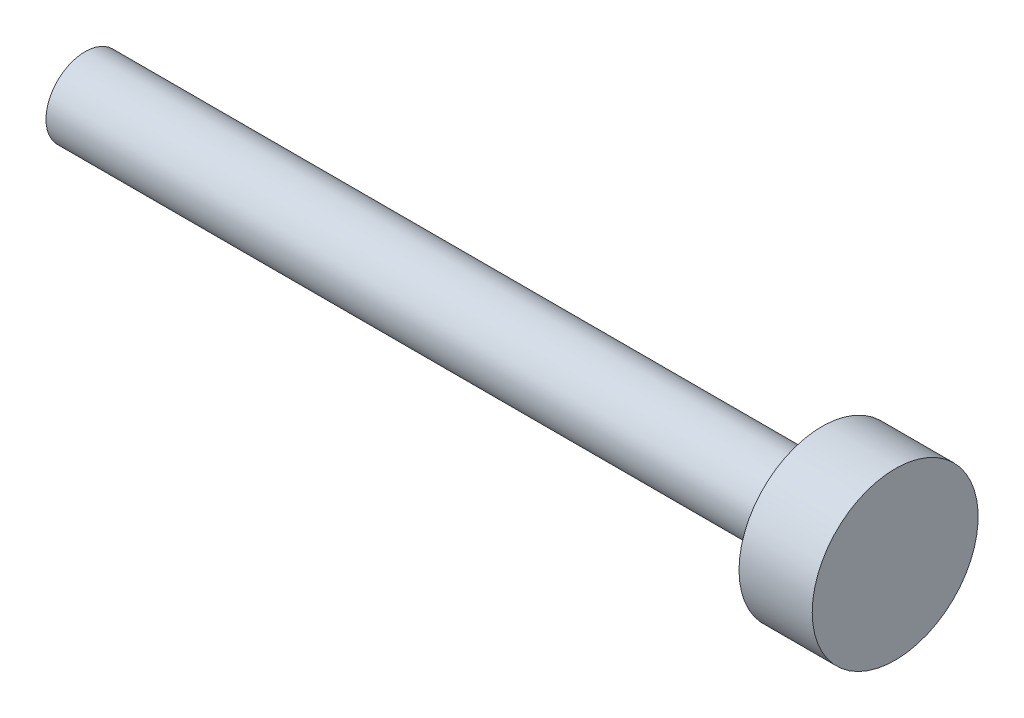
ISO-10303-21;
HEADER;
FILE_DESCRIPTION(('STEP AP214'),'2;1');
FILE_NAME('part.step','',(''),(''),'','','');
FILE_SCHEMA(('AUTOMOTIVE_DESIGN { 1 0 10303 214 1 1 1 1 }'));
ENDSEC;
DATA;
#1=APPLICATION_CONTEXT('core data for automotive mechanical design processes');
#2=APPLICATION_PROTOCOL_DEFINITION('international standard','automotive_design',2000,#1);
#3=PRODUCT_CONTEXT('',#1,'mechanical');
#4=PRODUCT('Part','Part','',(#3));
#5=PRODUCT_RELATED_PRODUCT_CATEGORY('part','',(#4));
#6=PRODUCT_DEFINITION_FORMATION('','',#4);
#7=PRODUCT_DEFINITION_CONTEXT('part definition',#1,'design');
#8=PRODUCT_DEFINITION('design','',#6,#7);
#9=PRODUCT_DEFINITION_SHAPE('','',#8);
#10=(LENGTH_UNIT() NAMED_UNIT(*) SI_UNIT(.MILLI.,.METRE.));
#11=(NAMED_UNIT(*) PLANE_ANGLE_UNIT() SI_UNIT($,.RADIAN.));
#12=(NAMED_UNIT(*) SI_UNIT($,.STERADIAN.) SOLID_ANGLE_UNIT());
#13=UNCERTAINTY_MEASURE_WITH_UNIT(LENGTH_MEASURE(1.E-05),#10,'distance_accuracy_value','');
#14=(GEOMETRIC_REPRESENTATION_CONTEXT(3) GLOBAL_UNCERTAINTY_ASSIGNED_CONTEXT((#13)) GLOBAL_UNIT_ASSIGNED_CONTEXT((#10,
#11,#12)) REPRESENTATION_CONTEXT('',''));
#15=CARTESIAN_POINT('',(0.,0.,0.));
#16=DIRECTION('',(0.,0.,1.));
#17=DIRECTION('',(1.,0.,0.));
#18=AXIS2_PLACEMENT_3D('',#15,#16,#17);
#19=CARTESIAN_POINT('',(43.,0.,0.));
#20=DIRECTION('',(1.,0.,0.));
#21=DIRECTION('',(0.,0.,-1.));
#22=AXIS2_PLACEMENT_3D('',#19,#20,#21);
#23=PLANE('',#22);
#24=CARTESIAN_POINT('',(43.,0.,0.));
#25=DIRECTION('',(-1.,0.,0.));
#26=DIRECTION('',(0.,0.,1.));
#27=AXIS2_PLACEMENT_3D('',#24,#25,#26);
#28=CIRCLE('',#27,4.25);
#29=CARTESIAN_POINT('',(43.,0.,4.25));
#30=VERTEX_POINT('',#29);
#31=EDGE_CURVE('E371',#30,#30,#28,.T.);
#32=ORIENTED_EDGE('',*,*,#31,.F.);
#33=EDGE_LOOP('',(#32));
#34=FACE_BOUND('',#33,.T.);
#35=CARTESIAN_POINT('',(43.,0.,0.));
#36=DIRECTION('',(-1.,0.,0.));
#37=DIRECTION('',(0.,0.,1.));
#38=AXIS2_PLACEMENT_3D('',#35,#36,#37);
#39=CIRCLE('',#38,8.);
#40=CARTESIAN_POINT('',(43.,0.,8.));
#41=VERTEX_POINT('',#40);
#42=EDGE_CURVE('E12',#41,#41,#39,.T.);
#43=ORIENTED_EDGE('',*,*,#42,.T.);
#44=EDGE_LOOP('',(#43));
#45=FACE_BOUND('',#44,.T.);
#46=ADVANCED_FACE('F351',(#34,#45),#23,.F.);
#47=CARTESIAN_POINT('',(0.,0.,0.));
#48=DIRECTION('',(-1.,0.,0.));
#49=DIRECTION('',(0.,0.,1.));
#50=AXIS2_PLACEMENT_3D('',#47,#48,#49);
#51=CYLINDRICAL_SURFACE('',#50,8.);
#52=ORIENTED_EDGE('',*,*,#42,.F.);
#53=EDGE_LOOP('',(#52));
#54=FACE_BOUND('',#53,.T.);
#55=CARTESIAN_POINT('',(194.,0.,0.));
#56=DIRECTION('',(-1.,0.,0.));
#57=DIRECTION('',(0.,0.,1.));
#58=AXIS2_PLACEMENT_3D('',#55,#56,#57);
#59=CIRCLE('',#58,8.);
#60=CARTESIAN_POINT('',(194.,0.,8.));
#61=VERTEX_POINT('',#60);
#62=EDGE_CURVE('E359',#61,#61,#59,.T.);
#63=ORIENTED_EDGE('',*,*,#62,.T.);
#64=EDGE_LOOP('',(#63));
#65=FACE_BOUND('',#64,.T.);
#66=ADVANCED_FACE('F385',(#54,#65),#51,.T.);
#67=CARTESIAN_POINT('',(194.,8.,0.));
#68=DIRECTION('',(1.,0.,0.));
#69=DIRECTION('',(0.,0.,-1.));
#70=AXIS2_PLACEMENT_3D('',#67,#68,#69);
#71=PLANE('',#70);
#72=ORIENTED_EDGE('',*,*,#62,.F.);
#73=EDGE_LOOP('',(#72));
#74=FACE_BOUND('',#73,.T.);
#75=CARTESIAN_POINT('',(194.,0.,0.));
#76=DIRECTION('',(-1.,0.,0.));
#77=DIRECTION('',(0.,0.,1.));
#78=AXIS2_PLACEMENT_3D('',#75,#76,#77);
#79=CIRCLE('',#78,17.);
#80=CARTESIAN_POINT('',(194.,0.,17.));
#81=VERTEX_POINT('',#80);
#82=EDGE_CURVE('E380',#81,#81,#79,.T.);
#83=ORIENTED_EDGE('',*,*,#82,.T.);
#84=EDGE_LOOP('',(#83));
#85=FACE_BOUND('',#84,.T.);
#86=ADVANCED_FACE('F387',(#74,#85),#71,.F.);
#87=CARTESIAN_POINT('',(0.,0.,0.));
#88=DIRECTION('',(-1.,0.,0.));
#89=DIRECTION('',(0.,0.,1.));
#90=AXIS2_PLACEMENT_3D('',#87,#88,#89);
#91=CYLINDRICAL_SURFACE('',#90,17.);
#92=ORIENTED_EDGE('',*,*,#82,.F.);
#93=EDGE_LOOP('',(#92));
#94=FACE_BOUND('',#93,.T.);
#95=CARTESIAN_POINT('',(209.,0.,0.));
#96=DIRECTION('',(-1.,0.,0.));
#97=DIRECTION('',(0.,0.,1.));
#98=AXIS2_PLACEMENT_3D('',#95,#96,#97);
#99=CIRCLE('',#98,17.);
#100=CARTESIAN_POINT('',(209.,0.,17.));
#101=VERTEX_POINT('',#100);
#102=EDGE_CURVE('E374',#101,#101,#99,.T.);
#103=ORIENTED_EDGE('',*,*,#102,.T.);
#104=EDGE_LOOP('',(#103));
#105=FACE_BOUND('',#104,.T.);
#106=ADVANCED_FACE('F390',(#94,#105),#91,.T.);
#107=CARTESIAN_POINT('',(209.,17.,0.));
#108=DIRECTION('',(-1.,0.,0.));
#109=DIRECTION('',(0.,0.,1.));
#110=AXIS2_PLACEMENT_3D('',#107,#108,#109);
#111=PLANE('',#110);
#112=ORIENTED_EDGE('',*,*,#102,.F.);
#113=EDGE_LOOP('',(#112));
#114=FACE_BOUND('',#113,.T.);
#115=ADVANCED_FACE('F396',(#114),#111,.F.);
#116=CARTESIAN_POINT('',(43.,0.,0.));
#117=DIRECTION('',(-1.,0.,0.));
#118=DIRECTION('',(0.,0.,1.));
#119=AXIS2_PLACEMENT_3D('',#116,#117,#118);
#120=CYLINDRICAL_SURFACE('',#119,4.24999999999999);
#121=CARTESIAN_POINT('',(65.5,0.,0.));
#122=DIRECTION('',(-1.,0.,0.));
#123=DIRECTION('',(0.,0.,1.));
#124=AXIS2_PLACEMENT_3D('',#121,#122,#123);
#125=CIRCLE('',#124,4.24999999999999);
#126=CARTESIAN_POINT('',(65.5,0.,4.24999999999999));
#127=VERTEX_POINT('',#126);
#128=EDGE_CURVE('E369',#127,#127,#125,.T.);
#129=ORIENTED_EDGE('',*,*,#128,.F.);
#130=EDGE_LOOP('',(#129));
#131=FACE_BOUND('',#130,.T.);
#132=ORIENTED_EDGE('',*,*,#31,.T.);
#133=EDGE_LOOP('',(#132));
#134=FACE_BOUND('',#133,.T.);
#135=ADVANCED_FACE('F365',(#131,#134),#120,.F.);
#136=CARTESIAN_POINT('',(65.5,0.,0.));
#137=DIRECTION('',(-1.,0.,0.));
#138=DIRECTION('',(0.,0.,1.));
#139=AXIS2_PLACEMENT_3D('',#136,#137,#138);
#140=CONICAL_SURFACE('',#139,4.24999999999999,1.02974425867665);
#141=CARTESIAN_POINT('',(68.0536576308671,0.,0.));
#142=VERTEX_POINT('',#141);
#143=VERTEX_LOOP('',#142);
#144=FACE_BOUND('',#143,.T.);
#145=ORIENTED_EDGE('',*,*,#128,.T.);
#146=EDGE_LOOP('',(#145));
#147=FACE_BOUND('',#146,.T.);
#148=ADVANCED_FACE('F362',(#144,#147),#140,.F.);
#149=CLOSED_SHELL('',(#46,#66,#86,#106,#115,#135,#148));
#150=MANIFOLD_SOLID_BREP('B2',#149);
#151=ADVANCED_BREP_SHAPE_REPRESENTATION('',(#18,#150),#14);
#152=SHAPE_DEFINITION_REPRESENTATION(#9,#151);
ENDSEC;
END-ISO-10303-21;
